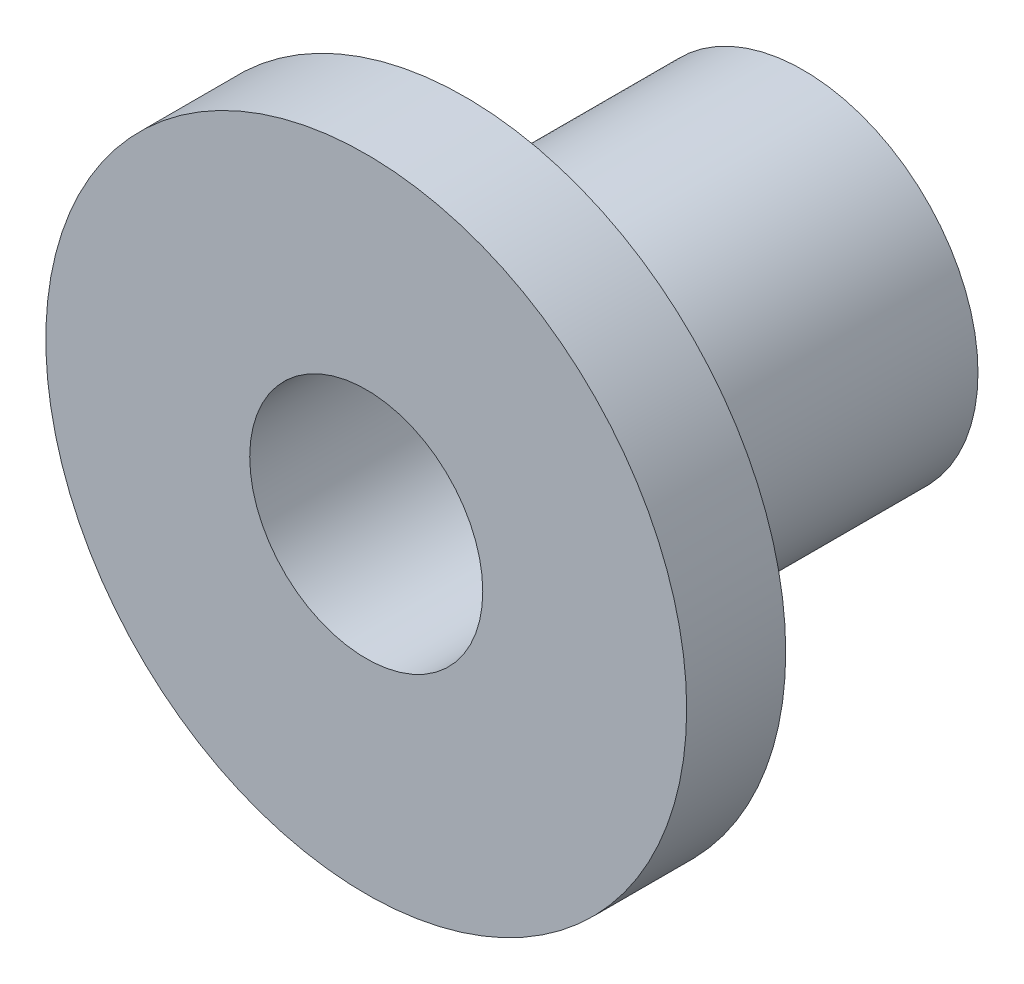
from build123d import *

# Parameters (mm, degrees)
SKETCH1_R           = 6
SKETCH1_R_2         = 4
BOSS_EXTRUDE1_DEPTH = 15
BOSS_EXTRUDE2_START = -3.4
SKETCH2_R           = 11
SKETCH2_R_2         = 4
BOSS_EXTRUDE2_DEPTH = 3.4


with BuildPart() as part:
    # Sketch1 → Boss-Extrude1 (new body)
    with BuildSketch(Plane.XY):
        Circle(SKETCH1_R)
        Circle(SKETCH1_R_2, mode=Mode.SUBTRACT)
    extrude(amount=BOSS_EXTRUDE1_DEPTH)

    # Sketch2 → Boss-Extrude2 (add)
    with BuildSketch(Plane.XY.offset(15).offset(BOSS_EXTRUDE2_START)):
        Circle(SKETCH2_R)
        Circle(SKETCH2_R_2, mode=Mode.SUBTRACT)
    extrude(amount=BOSS_EXTRUDE2_DEPTH)


solid = part.part
